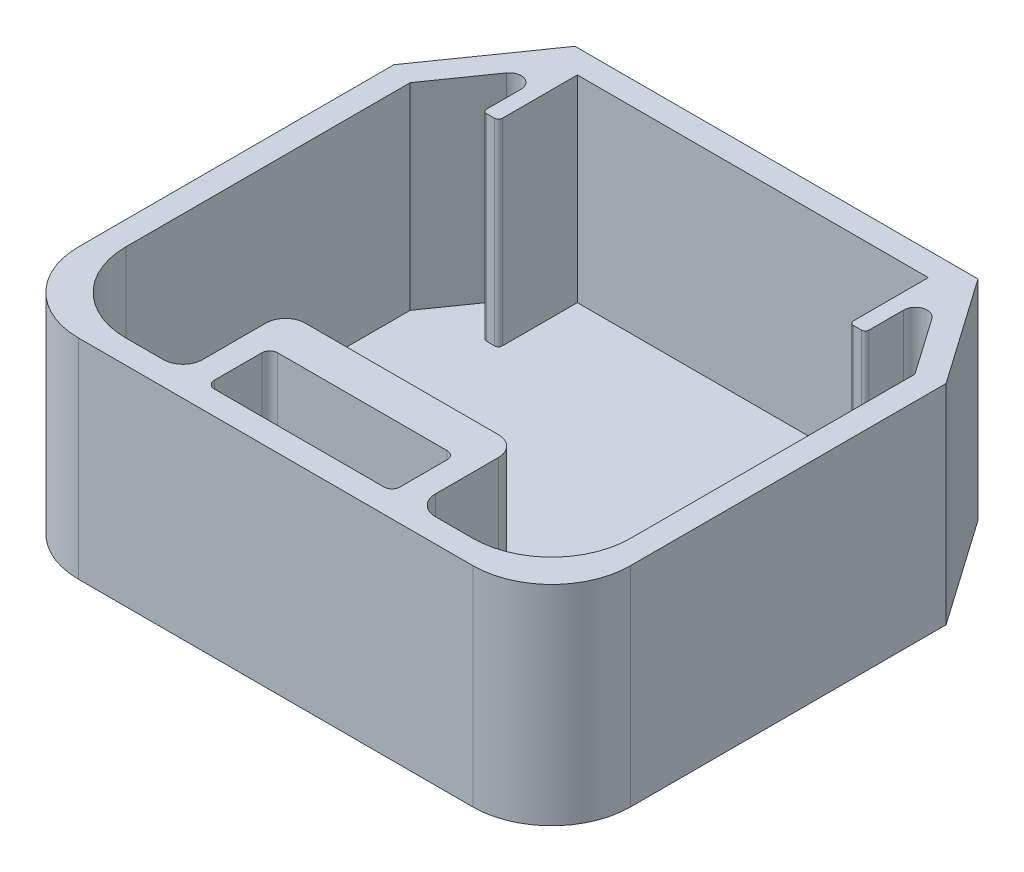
ISO-10303-21;
HEADER;
FILE_DESCRIPTION(('STEP AP214'),'2;1');
FILE_NAME('part.step','',(''),(''),'','','');
FILE_SCHEMA(('AUTOMOTIVE_DESIGN { 1 0 10303 214 1 1 1 1 }'));
ENDSEC;
DATA;
#1=APPLICATION_CONTEXT('core data for automotive mechanical design processes');
#2=APPLICATION_PROTOCOL_DEFINITION('international standard','automotive_design',2000,#1);
#3=PRODUCT_CONTEXT('',#1,'mechanical');
#4=PRODUCT('Part','Part','',(#3));
#5=PRODUCT_RELATED_PRODUCT_CATEGORY('part','',(#4));
#6=PRODUCT_DEFINITION_FORMATION('','',#4);
#7=PRODUCT_DEFINITION_CONTEXT('part definition',#1,'design');
#8=PRODUCT_DEFINITION('design','',#6,#7);
#9=PRODUCT_DEFINITION_SHAPE('','',#8);
#10=(LENGTH_UNIT() NAMED_UNIT(*) SI_UNIT(.MILLI.,.METRE.));
#11=(NAMED_UNIT(*) PLANE_ANGLE_UNIT() SI_UNIT($,.RADIAN.));
#12=(NAMED_UNIT(*) SI_UNIT($,.STERADIAN.) SOLID_ANGLE_UNIT());
#13=UNCERTAINTY_MEASURE_WITH_UNIT(LENGTH_MEASURE(1.E-05),#10,'distance_accuracy_value','');
#14=(GEOMETRIC_REPRESENTATION_CONTEXT(3) GLOBAL_UNCERTAINTY_ASSIGNED_CONTEXT((#13)) GLOBAL_UNIT_ASSIGNED_CONTEXT((#10,
#11,#12)) REPRESENTATION_CONTEXT('',''));
#15=CARTESIAN_POINT('',(0.,0.,0.));
#16=DIRECTION('',(0.,0.,1.));
#17=DIRECTION('',(1.,0.,0.));
#18=AXIS2_PLACEMENT_3D('',#15,#16,#17);
#19=CARTESIAN_POINT('',(0.,0.3,0.));
#20=DIRECTION('',(0.,1.,0.));
#21=DIRECTION('',(0.,0.,1.));
#22=AXIS2_PLACEMENT_3D('',#19,#20,#21);
#23=PLANE('',#22);
#24=DIRECTION('',(-0.57357643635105,0.,-0.819152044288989));
#25=VECTOR('',#24,1.);
#26=CARTESIAN_POINT('',(6.4,0.3,-3.46082072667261));
#27=LINE('',#26,#25);
#28=CARTESIAN_POINT('',(6.4,0.3,-3.46082072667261));
#29=VERTEX_POINT('',#28);
#30=CARTESIAN_POINT('',(5.3957456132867,0.3,-4.89504462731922));
#31=VERTEX_POINT('',#30);
#32=EDGE_CURVE('E369',#29,#31,#27,.T.);
#33=ORIENTED_EDGE('',*,*,#32,.T.);
#34=CARTESIAN_POINT('',(5.15,0.3,-4.72297169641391));
#35=DIRECTION('',(0.,1.,0.));
#36=DIRECTION('',(0.,0.,1.));
#37=AXIS2_PLACEMENT_3D('',#34,#35,#36);
#38=CIRCLE('',#37,0.3);
#39=CARTESIAN_POINT('',(4.85,0.3,-4.72297169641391));
#40=VERTEX_POINT('',#39);
#41=EDGE_CURVE('E528',#31,#40,#38,.T.);
#42=ORIENTED_EDGE('',*,*,#41,.T.);
#43=DIRECTION('',(0.,0.,-1.));
#44=VECTOR('',#43,1.);
#45=CARTESIAN_POINT('',(4.85,0.3,-5.75));
#46=LINE('',#45,#44);
#47=CARTESIAN_POINT('',(4.85,0.3,-3.85));
#48=VERTEX_POINT('',#47);
#49=EDGE_CURVE('E606',#48,#40,#46,.T.);
#50=ORIENTED_EDGE('',*,*,#49,.F.);
#51=CARTESIAN_POINT('',(4.75,0.3,-3.85));
#52=DIRECTION('',(0.,1.,0.));
#53=DIRECTION('',(0.,0.,1.));
#54=AXIS2_PLACEMENT_3D('',#51,#52,#53);
#55=CIRCLE('',#54,0.1);
#56=CARTESIAN_POINT('',(4.75,0.3,-3.75));
#57=VERTEX_POINT('',#56);
#58=EDGE_CURVE('E569',#48,#57,#55,.F.);
#59=ORIENTED_EDGE('',*,*,#58,.T.);
#60=DIRECTION('',(1.,0.,0.));
#61=VECTOR('',#60,1.);
#62=CARTESIAN_POINT('',(4.45,0.3,-3.75));
#63=LINE('',#62,#61);
#64=CARTESIAN_POINT('',(4.55,0.3,-3.75));
#65=VERTEX_POINT('',#64);
#66=EDGE_CURVE('E577',#65,#57,#63,.T.);
#67=ORIENTED_EDGE('',*,*,#66,.F.);
#68=CARTESIAN_POINT('',(4.55,0.3,-3.85));
#69=DIRECTION('',(0.,1.,0.));
#70=DIRECTION('',(0.,0.,1.));
#71=AXIS2_PLACEMENT_3D('',#68,#69,#70);
#72=CIRCLE('',#71,0.1);
#73=CARTESIAN_POINT('',(4.45,0.3,-3.85));
#74=VERTEX_POINT('',#73);
#75=EDGE_CURVE('E571',#65,#74,#72,.F.);
#76=ORIENTED_EDGE('',*,*,#75,.T.);
#77=DIRECTION('',(0.,0.,1.));
#78=VECTOR('',#77,1.);
#79=CARTESIAN_POINT('',(4.45,0.3,-3.75));
#80=LINE('',#79,#78);
#81=CARTESIAN_POINT('',(4.45,0.3,-5.75));
#82=VERTEX_POINT('',#81);
#83=EDGE_CURVE('E574',#82,#74,#80,.T.);
#84=ORIENTED_EDGE('',*,*,#83,.F.);
#85=DIRECTION('',(-1.,0.,0.));
#86=VECTOR('',#85,1.);
#87=CARTESIAN_POINT('',(4.79709941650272,0.3,-5.75));
#88=LINE('',#87,#86);
#89=CARTESIAN_POINT('',(-4.45,0.3,-5.75));
#90=VERTEX_POINT('',#89);
#91=EDGE_CURVE('E355',#82,#90,#88,.T.);
#92=ORIENTED_EDGE('',*,*,#91,.T.);
#93=DIRECTION('',(0.,0.,-1.));
#94=VECTOR('',#93,1.);
#95=CARTESIAN_POINT('',(-4.45,0.3,-5.75));
#96=LINE('',#95,#94);
#97=CARTESIAN_POINT('',(-4.45,0.3,-3.85));
#98=VERTEX_POINT('',#97);
#99=EDGE_CURVE('E607',#98,#90,#96,.T.);
#100=ORIENTED_EDGE('',*,*,#99,.F.);
#101=CARTESIAN_POINT('',(-4.55,0.3,-3.85));
#102=DIRECTION('',(0.,1.,0.));
#103=DIRECTION('',(0.,0.,1.));
#104=AXIS2_PLACEMENT_3D('',#101,#102,#103);
#105=CIRCLE('',#104,0.1);
#106=CARTESIAN_POINT('',(-4.55,0.3,-3.75));
#107=VERTEX_POINT('',#106);
#108=EDGE_CURVE('E42',#98,#107,#105,.F.);
#109=ORIENTED_EDGE('',*,*,#108,.T.);
#110=DIRECTION('',(1.,0.,0.));
#111=VECTOR('',#110,1.);
#112=CARTESIAN_POINT('',(-4.85,0.3,-3.75));
#113=LINE('',#112,#111);
#114=CARTESIAN_POINT('',(-4.75,0.3,-3.75));
#115=VERTEX_POINT('',#114);
#116=EDGE_CURVE('E610',#115,#107,#113,.T.);
#117=ORIENTED_EDGE('',*,*,#116,.F.);
#118=CARTESIAN_POINT('',(-4.75,0.3,-3.85));
#119=DIRECTION('',(0.,1.,0.));
#120=DIRECTION('',(0.,0.,1.));
#121=AXIS2_PLACEMENT_3D('',#118,#119,#120);
#122=CIRCLE('',#121,0.1);
#123=CARTESIAN_POINT('',(-4.85,0.3,-3.85));
#124=VERTEX_POINT('',#123);
#125=EDGE_CURVE('E11',#115,#124,#122,.F.);
#126=ORIENTED_EDGE('',*,*,#125,.T.);
#127=DIRECTION('',(0.,0.,1.));
#128=VECTOR('',#127,1.);
#129=CARTESIAN_POINT('',(-4.85,0.3,-5.75));
#130=LINE('',#129,#128);
#131=CARTESIAN_POINT('',(-4.85,0.3,-4.72297169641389));
#132=VERTEX_POINT('',#131);
#133=EDGE_CURVE('E612',#132,#124,#130,.T.);
#134=ORIENTED_EDGE('',*,*,#133,.F.);
#135=CARTESIAN_POINT('',(-5.15,0.3,-4.72297169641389));
#136=DIRECTION('',(0.,1.,0.));
#137=DIRECTION('',(0.,0.,1.));
#138=AXIS2_PLACEMENT_3D('',#135,#136,#137);
#139=CIRCLE('',#138,0.3);
#140=CARTESIAN_POINT('',(-5.3957456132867,0.3,-4.89504462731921));
#141=VERTEX_POINT('',#140);
#142=EDGE_CURVE('E526',#132,#141,#139,.T.);
#143=ORIENTED_EDGE('',*,*,#142,.T.);
#144=DIRECTION('',(-0.573576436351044,0.,0.819152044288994));
#145=VECTOR('',#144,1.);
#146=CARTESIAN_POINT('',(-4.79709941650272,0.3,-5.75));
#147=LINE('',#146,#145);
#148=CARTESIAN_POINT('',(-6.4,0.3,-3.46082072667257));
#149=VERTEX_POINT('',#148);
#150=EDGE_CURVE('E358',#141,#149,#147,.T.);
#151=ORIENTED_EDGE('',*,*,#150,.T.);
#152=DIRECTION('',(0.,0.,1.));
#153=VECTOR('',#152,1.);
#154=CARTESIAN_POINT('',(-6.4,0.3,-3.46082072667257));
#155=LINE('',#154,#153);
#156=CARTESIAN_POINT('',(-6.4,0.3,3.75));
#157=VERTEX_POINT('',#156);
#158=EDGE_CURVE('E332',#149,#157,#155,.T.);
#159=ORIENTED_EDGE('',*,*,#158,.T.);
#160=CARTESIAN_POINT('',(-4.4,0.3,3.75));
#161=DIRECTION('',(0.,1.,0.));
#162=DIRECTION('',(0.,0.,1.));
#163=AXIS2_PLACEMENT_3D('',#160,#161,#162);
#164=CIRCLE('',#163,2.);
#165=CARTESIAN_POINT('',(-4.4,0.3,5.75));
#166=VERTEX_POINT('',#165);
#167=EDGE_CURVE('E439',#157,#166,#164,.T.);
#168=ORIENTED_EDGE('',*,*,#167,.T.);
#169=DIRECTION('',(1.,0.,0.));
#170=VECTOR('',#169,1.);
#171=CARTESIAN_POINT('',(-6.4,0.3,5.75));
#172=LINE('',#171,#170);
#173=CARTESIAN_POINT('',(-3.45,0.3,5.75));
#174=VERTEX_POINT('',#173);
#175=EDGE_CURVE('E363',#166,#174,#172,.T.);
#176=ORIENTED_EDGE('',*,*,#175,.T.);
#177=CARTESIAN_POINT('',(-3.45,0.3,5.25));
#178=DIRECTION('',(0.,1.,0.));
#179=DIRECTION('',(0.,0.,1.));
#180=AXIS2_PLACEMENT_3D('',#177,#178,#179);
#181=CIRCLE('',#180,0.5);
#182=CARTESIAN_POINT('',(-2.95,0.3,5.25));
#183=VERTEX_POINT('',#182);
#184=EDGE_CURVE('E460',#174,#183,#181,.T.);
#185=ORIENTED_EDGE('',*,*,#184,.T.);
#186=DIRECTION('',(0.,0.,-1.));
#187=VECTOR('',#186,1.);
#188=CARTESIAN_POINT('',(-2.95,0.3,3.15));
#189=LINE('',#188,#187);
#190=CARTESIAN_POINT('',(-2.95,0.3,3.65));
#191=VERTEX_POINT('',#190);
#192=EDGE_CURVE('E637',#183,#191,#189,.T.);
#193=ORIENTED_EDGE('',*,*,#192,.T.);
#194=CARTESIAN_POINT('',(-2.45,0.3,3.65));
#195=DIRECTION('',(0.,1.,0.));
#196=DIRECTION('',(0.,0.,1.));
#197=AXIS2_PLACEMENT_3D('',#194,#195,#196);
#198=CIRCLE('',#197,0.5);
#199=CARTESIAN_POINT('',(-2.45,0.3,3.15));
#200=VERTEX_POINT('',#199);
#201=EDGE_CURVE('E485',#191,#200,#198,.F.);
#202=ORIENTED_EDGE('',*,*,#201,.T.);
#203=DIRECTION('',(1.,0.,0.));
#204=VECTOR('',#203,1.);
#205=CARTESIAN_POINT('',(2.95,0.3,3.15));
#206=LINE('',#205,#204);
#207=CARTESIAN_POINT('',(2.45,0.3,3.15));
#208=VERTEX_POINT('',#207);
#209=EDGE_CURVE('E634',#200,#208,#206,.T.);
#210=ORIENTED_EDGE('',*,*,#209,.T.);
#211=CARTESIAN_POINT('',(2.45,0.3,3.65));
#212=DIRECTION('',(0.,1.,0.));
#213=DIRECTION('',(0.,0.,1.));
#214=AXIS2_PLACEMENT_3D('',#211,#212,#213);
#215=CIRCLE('',#214,0.5);
#216=CARTESIAN_POINT('',(2.95,0.3,3.65));
#217=VERTEX_POINT('',#216);
#218=EDGE_CURVE('E483',#208,#217,#215,.F.);
#219=ORIENTED_EDGE('',*,*,#218,.T.);
#220=DIRECTION('',(0.,0.,1.));
#221=VECTOR('',#220,1.);
#222=CARTESIAN_POINT('',(2.95,0.3,5.75));
#223=LINE('',#222,#221);
#224=CARTESIAN_POINT('',(2.95,0.3,5.25));
#225=VERTEX_POINT('',#224);
#226=EDGE_CURVE('E631',#217,#225,#223,.T.);
#227=ORIENTED_EDGE('',*,*,#226,.T.);
#228=CARTESIAN_POINT('',(3.45,0.3,5.25));
#229=DIRECTION('',(0.,1.,0.));
#230=DIRECTION('',(0.,0.,1.));
#231=AXIS2_PLACEMENT_3D('',#228,#229,#230);
#232=CIRCLE('',#231,0.5);
#233=CARTESIAN_POINT('',(3.45,0.3,5.75));
#234=VERTEX_POINT('',#233);
#235=EDGE_CURVE('E458',#225,#234,#232,.T.);
#236=ORIENTED_EDGE('',*,*,#235,.T.);
#237=CARTESIAN_POINT('',(4.4,0.3,5.75));
#238=VERTEX_POINT('',#237);
#239=EDGE_CURVE('E362',#234,#238,#172,.T.);
#240=ORIENTED_EDGE('',*,*,#239,.T.);
#241=CARTESIAN_POINT('',(4.4,0.3,3.75));
#242=DIRECTION('',(0.,1.,0.));
#243=DIRECTION('',(0.,0.,1.));
#244=AXIS2_PLACEMENT_3D('',#241,#242,#243);
#245=CIRCLE('',#244,2.);
#246=CARTESIAN_POINT('',(6.4,0.3,3.75));
#247=VERTEX_POINT('',#246);
#248=EDGE_CURVE('E441',#238,#247,#245,.T.);
#249=ORIENTED_EDGE('',*,*,#248,.T.);
#250=DIRECTION('',(0.,0.,-1.));
#251=VECTOR('',#250,1.);
#252=CARTESIAN_POINT('',(6.4,0.3,5.75));
#253=LINE('',#252,#251);
#254=EDGE_CURVE('E366',#247,#29,#253,.T.);
#255=ORIENTED_EDGE('',*,*,#254,.T.);
#256=EDGE_LOOP('',(#33,#42,#50,#59,#67,#76,#84,#92,#100,#109,#117,#126,#134,#143,#151,#159,#168,
#176,#185,#193,#202,#210,#219,#227,#236,#240,#249,#255));
#257=FACE_BOUND('',#256,.T.);
#258=ADVANCED_FACE('F34',(#257),#23,.T.);
#259=CARTESIAN_POINT('',(4.79709941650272,5.3,-5.75));
#260=DIRECTION('',(0.,0.,1.));
#261=DIRECTION('',(1.,0.,0.));
#262=AXIS2_PLACEMENT_3D('',#259,#260,#261);
#263=PLANE('',#262);
#264=ORIENTED_EDGE('',*,*,#91,.F.);
#265=DIRECTION('',(0.,-1.,0.));
#266=VECTOR('',#265,1.);
#267=CARTESIAN_POINT('',(4.45,7.33960780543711,-5.75));
#268=LINE('',#267,#266);
#269=CARTESIAN_POINT('',(4.45,5.3,-5.75));
#270=VERTEX_POINT('',#269);
#271=EDGE_CURVE('E586',#270,#82,#268,.T.);
#272=ORIENTED_EDGE('',*,*,#271,.F.);
#273=DIRECTION('',(-1.,0.,0.));
#274=VECTOR('',#273,1.);
#275=CARTESIAN_POINT('',(4.79709941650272,5.3,-5.75));
#276=LINE('',#275,#274);
#277=CARTESIAN_POINT('',(-4.45,5.3,-5.75));
#278=VERTEX_POINT('',#277);
#279=EDGE_CURVE('E324',#270,#278,#276,.T.);
#280=ORIENTED_EDGE('',*,*,#279,.T.);
#281=DIRECTION('',(0.,-1.,0.));
#282=VECTOR('',#281,1.);
#283=CARTESIAN_POINT('',(-4.45,7.33960780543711,-5.75));
#284=LINE('',#283,#282);
#285=EDGE_CURVE('E600',#278,#90,#284,.T.);
#286=ORIENTED_EDGE('',*,*,#285,.T.);
#287=EDGE_LOOP('',(#264,#272,#280,#286));
#288=FACE_BOUND('',#287,.T.);
#289=ADVANCED_FACE('F660',(#288),#263,.T.);
#290=CARTESIAN_POINT('',(6.4,5.3,-3.46082072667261));
#291=DIRECTION('',(-0.819152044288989,0.,0.57357643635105));
#292=DIRECTION('',(0.57357643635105,0.,0.819152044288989));
#293=AXIS2_PLACEMENT_3D('',#290,#291,#292);
#294=PLANE('',#293);
#295=DIRECTION('',(-0.57357643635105,0.,-0.819152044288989));
#296=VECTOR('',#295,1.);
#297=CARTESIAN_POINT('',(6.4,5.3,-3.46082072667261));
#298=LINE('',#297,#296);
#299=CARTESIAN_POINT('',(6.4,5.3,-3.46082072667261));
#300=VERTEX_POINT('',#299);
#301=CARTESIAN_POINT('',(5.3957456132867,5.3,-4.89504462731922));
#302=VERTEX_POINT('',#301);
#303=EDGE_CURVE('E352',#300,#302,#298,.T.);
#304=ORIENTED_EDGE('',*,*,#303,.T.);
#305=DIRECTION('',(0.,-1.,0.));
#306=VECTOR('',#305,1.);
#307=CARTESIAN_POINT('',(5.3957456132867,5.3,-4.89504462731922));
#308=LINE('',#307,#306);
#309=EDGE_CURVE('E523',#302,#31,#308,.T.);
#310=ORIENTED_EDGE('',*,*,#309,.T.);
#311=ORIENTED_EDGE('',*,*,#32,.F.);
#312=DIRECTION('',(0.,-1.,0.));
#313=VECTOR('',#312,1.);
#314=CARTESIAN_POINT('',(6.4,5.3,-3.46082072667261));
#315=LINE('',#314,#313);
#316=EDGE_CURVE('E334',#300,#29,#315,.T.);
#317=ORIENTED_EDGE('',*,*,#316,.F.);
#318=EDGE_LOOP('',(#304,#310,#311,#317));
#319=FACE_BOUND('',#318,.T.);
#320=ADVANCED_FACE('F701',(#319),#294,.T.);
#321=CARTESIAN_POINT('',(-4.79709941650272,5.3,-5.75));
#322=DIRECTION('',(0.819152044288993,0.,0.573576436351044));
#323=DIRECTION('',(0.573576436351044,0.,-0.819152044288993));
#324=AXIS2_PLACEMENT_3D('',#321,#322,#323);
#325=PLANE('',#324);
#326=ORIENTED_EDGE('',*,*,#150,.F.);
#327=DIRECTION('',(0.,1.,0.));
#328=VECTOR('',#327,1.);
#329=CARTESIAN_POINT('',(-5.3957456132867,5.3,-4.89504462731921));
#330=LINE('',#329,#328);
#331=CARTESIAN_POINT('',(-5.3957456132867,5.3,-4.89504462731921));
#332=VERTEX_POINT('',#331);
#333=EDGE_CURVE('E320',#141,#332,#330,.T.);
#334=ORIENTED_EDGE('',*,*,#333,.T.);
#335=DIRECTION('',(-0.573576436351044,0.,0.819152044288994));
#336=VECTOR('',#335,1.);
#337=CARTESIAN_POINT('',(-4.79709941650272,5.3,-5.75));
#338=LINE('',#337,#336);
#339=CARTESIAN_POINT('',(-6.4,5.3,-3.46082072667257));
#340=VERTEX_POINT('',#339);
#341=EDGE_CURVE('E313',#332,#340,#338,.T.);
#342=ORIENTED_EDGE('',*,*,#341,.T.);
#343=DIRECTION('',(0.,-1.,0.));
#344=VECTOR('',#343,1.);
#345=CARTESIAN_POINT('',(-6.4,5.3,-3.46082072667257));
#346=LINE('',#345,#344);
#347=EDGE_CURVE('E317',#340,#149,#346,.T.);
#348=ORIENTED_EDGE('',*,*,#347,.T.);
#349=EDGE_LOOP('',(#326,#334,#342,#348));
#350=FACE_BOUND('',#349,.T.);
#351=ADVANCED_FACE('F316',(#350),#325,.T.);
#352=CARTESIAN_POINT('',(-6.4,5.3,5.75));
#353=DIRECTION('',(0.,0.,-1.));
#354=DIRECTION('',(-1.,0.,0.));
#355=AXIS2_PLACEMENT_3D('',#352,#353,#354);
#356=PLANE('',#355);
#357=ORIENTED_EDGE('',*,*,#239,.F.);
#358=DIRECTION('',(0.,1.,0.));
#359=VECTOR('',#358,1.);
#360=CARTESIAN_POINT('',(3.45,5.3,5.75));
#361=LINE('',#360,#359);
#362=CARTESIAN_POINT('',(3.45,5.3,5.75));
#363=VERTEX_POINT('',#362);
#364=EDGE_CURVE('E462',#234,#363,#361,.T.);
#365=ORIENTED_EDGE('',*,*,#364,.T.);
#366=DIRECTION('',(1.,0.,0.));
#367=VECTOR('',#366,1.);
#368=CARTESIAN_POINT('',(-6.4,5.3,5.75));
#369=LINE('',#368,#367);
#370=CARTESIAN_POINT('',(4.4,5.3,5.75));
#371=VERTEX_POINT('',#370);
#372=EDGE_CURVE('E342',#363,#371,#369,.T.);
#373=ORIENTED_EDGE('',*,*,#372,.T.);
#374=DIRECTION('',(0.,-1.,0.));
#375=VECTOR('',#374,1.);
#376=CARTESIAN_POINT('',(4.4,0.3,5.75));
#377=LINE('',#376,#375);
#378=EDGE_CURVE('E436',#371,#238,#377,.T.);
#379=ORIENTED_EDGE('',*,*,#378,.T.);
#380=EDGE_LOOP('',(#357,#365,#373,#379));
#381=FACE_BOUND('',#380,.T.);
#382=ADVANCED_FACE('F759',(#381),#356,.T.);
#383=CARTESIAN_POINT('',(-4.4,5.3,5.75));
#384=VERTEX_POINT('',#383);
#385=CARTESIAN_POINT('',(-3.45,5.3,5.75));
#386=VERTEX_POINT('',#385);
#387=EDGE_CURVE('E346',#384,#386,#369,.T.);
#388=ORIENTED_EDGE('',*,*,#387,.T.);
#389=DIRECTION('',(0.,1.,0.));
#390=VECTOR('',#389,1.);
#391=CARTESIAN_POINT('',(-3.45,0.3,5.75));
#392=LINE('',#391,#390);
#393=EDGE_CURVE('E456',#386,#174,#392,.F.);
#394=ORIENTED_EDGE('',*,*,#393,.T.);
#395=ORIENTED_EDGE('',*,*,#175,.F.);
#396=DIRECTION('',(0.,-1.,0.));
#397=VECTOR('',#396,1.);
#398=CARTESIAN_POINT('',(-4.4,5.3,5.75));
#399=LINE('',#398,#397);
#400=EDGE_CURVE('E434',#166,#384,#399,.F.);
#401=ORIENTED_EDGE('',*,*,#400,.T.);
#402=EDGE_LOOP('',(#388,#394,#395,#401));
#403=FACE_BOUND('',#402,.T.);
#404=ADVANCED_FACE('F760',(#403),#356,.T.);
#405=CARTESIAN_POINT('',(-7.,0.3,-3.64999999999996));
#406=DIRECTION('',(1.,0.,0.));
#407=DIRECTION('',(0.,0.,-1.));
#408=AXIS2_PLACEMENT_3D('',#405,#406,#407);
#409=PLANE('',#408);
#410=DIRECTION('',(0.,0.,1.));
#411=VECTOR('',#410,1.);
#412=CARTESIAN_POINT('',(-7.,0.,-3.64999999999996));
#413=LINE('',#412,#411);
#414=CARTESIAN_POINT('',(-7.,0.,-3.64999999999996));
#415=VERTEX_POINT('',#414);
#416=CARTESIAN_POINT('',(-7.,0.,4.35));
#417=VERTEX_POINT('',#416);
#418=EDGE_CURVE('E390',#415,#417,#413,.T.);
#419=ORIENTED_EDGE('',*,*,#418,.T.);
#420=DIRECTION('',(0.,-1.,0.));
#421=VECTOR('',#420,1.);
#422=CARTESIAN_POINT('',(-7.,0.3,4.35));
#423=LINE('',#422,#421);
#424=CARTESIAN_POINT('',(-7.,5.3,4.35));
#425=VERTEX_POINT('',#424);
#426=EDGE_CURVE('E425',#417,#425,#423,.F.);
#427=ORIENTED_EDGE('',*,*,#426,.T.);
#428=DIRECTION('',(0.,0.,1.));
#429=VECTOR('',#428,1.);
#430=CARTESIAN_POINT('',(-7.,5.3,-3.64999999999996));
#431=LINE('',#430,#429);
#432=CARTESIAN_POINT('',(-7.,5.3,-3.64999999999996));
#433=VERTEX_POINT('',#432);
#434=EDGE_CURVE('E379',#433,#425,#431,.T.);
#435=ORIENTED_EDGE('',*,*,#434,.F.);
#436=DIRECTION('',(0.,-1.,0.));
#437=VECTOR('',#436,1.);
#438=CARTESIAN_POINT('',(-7.,0.3,-3.64999999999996));
#439=LINE('',#438,#437);
#440=EDGE_CURVE('E404',#433,#415,#439,.T.);
#441=ORIENTED_EDGE('',*,*,#440,.T.);
#442=EDGE_LOOP('',(#419,#427,#435,#441));
#443=FACE_BOUND('',#442,.T.);
#444=ADVANCED_FACE('F768',(#443),#409,.F.);
#445=CARTESIAN_POINT('',(-7.,0.3,6.35));
#446=DIRECTION('',(0.,0.,-1.));
#447=DIRECTION('',(-1.,0.,0.));
#448=AXIS2_PLACEMENT_3D('',#445,#446,#447);
#449=PLANE('',#448);
#450=DIRECTION('',(1.,0.,0.));
#451=VECTOR('',#450,1.);
#452=CARTESIAN_POINT('',(-7.,5.3,6.35));
#453=LINE('',#452,#451);
#454=CARTESIAN_POINT('',(-5.,5.3,6.35));
#455=VERTEX_POINT('',#454);
#456=CARTESIAN_POINT('',(5.,5.3,6.35));
#457=VERTEX_POINT('',#456);
#458=EDGE_CURVE('E382',#455,#457,#453,.T.);
#459=ORIENTED_EDGE('',*,*,#458,.F.);
#460=DIRECTION('',(0.,-1.,0.));
#461=VECTOR('',#460,1.);
#462=CARTESIAN_POINT('',(-5.,0.3,6.35));
#463=LINE('',#462,#461);
#464=CARTESIAN_POINT('',(-5.,0.,6.35));
#465=VERTEX_POINT('',#464);
#466=EDGE_CURVE('E418',#455,#465,#463,.T.);
#467=ORIENTED_EDGE('',*,*,#466,.T.);
#468=DIRECTION('',(1.,0.,0.));
#469=VECTOR('',#468,1.);
#470=CARTESIAN_POINT('',(-7.,0.,6.35));
#471=LINE('',#470,#469);
#472=CARTESIAN_POINT('',(5.,0.,6.35));
#473=VERTEX_POINT('',#472);
#474=EDGE_CURVE('E393',#465,#473,#471,.T.);
#475=ORIENTED_EDGE('',*,*,#474,.T.);
#476=DIRECTION('',(0.,-1.,0.));
#477=VECTOR('',#476,1.);
#478=CARTESIAN_POINT('',(5.,0.3,6.35));
#479=LINE('',#478,#477);
#480=EDGE_CURVE('E416',#473,#457,#479,.F.);
#481=ORIENTED_EDGE('',*,*,#480,.T.);
#482=EDGE_LOOP('',(#459,#467,#475,#481));
#483=FACE_BOUND('',#482,.T.);
#484=ADVANCED_FACE('F773',(#483),#449,.F.);
#485=CARTESIAN_POINT('',(7.,0.3,-3.65));
#486=DIRECTION('',(-1.,0.,0.));
#487=DIRECTION('',(0.,0.,1.));
#488=AXIS2_PLACEMENT_3D('',#485,#486,#487);
#489=PLANE('',#488);
#490=DIRECTION('',(0.,0.,-1.));
#491=VECTOR('',#490,1.);
#492=CARTESIAN_POINT('',(7.,5.3,6.35));
#493=LINE('',#492,#491);
#494=CARTESIAN_POINT('',(7.,5.3,4.35));
#495=VERTEX_POINT('',#494);
#496=CARTESIAN_POINT('',(7.,5.3,-3.65));
#497=VERTEX_POINT('',#496);
#498=EDGE_CURVE('E385',#495,#497,#493,.T.);
#499=ORIENTED_EDGE('',*,*,#498,.F.);
#500=DIRECTION('',(0.,-1.,0.));
#501=VECTOR('',#500,1.);
#502=CARTESIAN_POINT('',(7.,0.3,4.35));
#503=LINE('',#502,#501);
#504=CARTESIAN_POINT('',(7.,0.,4.35));
#505=VERTEX_POINT('',#504);
#506=EDGE_CURVE('E431',#495,#505,#503,.T.);
#507=ORIENTED_EDGE('',*,*,#506,.T.);
#508=DIRECTION('',(0.,0.,-1.));
#509=VECTOR('',#508,1.);
#510=CARTESIAN_POINT('',(7.,0.,-3.65));
#511=LINE('',#510,#509);
#512=CARTESIAN_POINT('',(7.,0.,-3.65));
#513=VERTEX_POINT('',#512);
#514=EDGE_CURVE('E396',#505,#513,#511,.T.);
#515=ORIENTED_EDGE('',*,*,#514,.T.);
#516=DIRECTION('',(0.,-1.,0.));
#517=VECTOR('',#516,1.);
#518=CARTESIAN_POINT('',(7.,0.3,-3.65));
#519=LINE('',#518,#517);
#520=EDGE_CURVE('E413',#497,#513,#519,.T.);
#521=ORIENTED_EDGE('',*,*,#520,.F.);
#522=EDGE_LOOP('',(#499,#507,#515,#521));
#523=FACE_BOUND('',#522,.T.);
#524=ADVANCED_FACE('F889',(#523),#489,.F.);
#525=CARTESIAN_POINT('',(5.10943964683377,0.3,-6.35));
#526=DIRECTION('',(-0.819152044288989,0.,0.57357643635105));
#527=DIRECTION('',(0.57357643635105,0.,0.819152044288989));
#528=AXIS2_PLACEMENT_3D('',#525,#526,#527);
#529=PLANE('',#528);
#530=DIRECTION('',(-0.57357643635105,0.,-0.819152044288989));
#531=VECTOR('',#530,1.);
#532=CARTESIAN_POINT('',(5.10943964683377,0.,-6.35));
#533=LINE('',#532,#531);
#534=CARTESIAN_POINT('',(5.10943964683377,0.,-6.35));
#535=VERTEX_POINT('',#534);
#536=EDGE_CURVE('E398',#513,#535,#533,.T.);
#537=ORIENTED_EDGE('',*,*,#536,.T.);
#538=DIRECTION('',(0.,-1.,0.));
#539=VECTOR('',#538,1.);
#540=CARTESIAN_POINT('',(5.10943964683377,0.3,-6.35));
#541=LINE('',#540,#539);
#542=CARTESIAN_POINT('',(5.10943964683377,5.3,-6.35));
#543=VERTEX_POINT('',#542);
#544=EDGE_CURVE('E410',#543,#535,#541,.T.);
#545=ORIENTED_EDGE('',*,*,#544,.F.);
#546=DIRECTION('',(-0.57357643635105,0.,-0.819152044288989));
#547=VECTOR('',#546,1.);
#548=CARTESIAN_POINT('',(7.,5.3,-3.65));
#549=LINE('',#548,#547);
#550=EDGE_CURVE('E387',#497,#543,#549,.T.);
#551=ORIENTED_EDGE('',*,*,#550,.F.);
#552=ORIENTED_EDGE('',*,*,#520,.T.);
#553=EDGE_LOOP('',(#537,#545,#551,#552));
#554=FACE_BOUND('',#553,.T.);
#555=ADVANCED_FACE('F885',(#554),#529,.F.);
#556=CARTESIAN_POINT('',(5.10943964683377,0.3,-6.35));
#557=DIRECTION('',(0.,0.,1.));
#558=DIRECTION('',(1.,0.,0.));
#559=AXIS2_PLACEMENT_3D('',#556,#557,#558);
#560=PLANE('',#559);
#561=DIRECTION('',(-1.,0.,0.));
#562=VECTOR('',#561,1.);
#563=CARTESIAN_POINT('',(5.10943964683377,0.,-6.35));
#564=LINE('',#563,#562);
#565=CARTESIAN_POINT('',(-5.10943964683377,0.,-6.35));
#566=VERTEX_POINT('',#565);
#567=EDGE_CURVE('E400',#535,#566,#564,.T.);
#568=ORIENTED_EDGE('',*,*,#567,.T.);
#569=DIRECTION('',(0.,-1.,0.));
#570=VECTOR('',#569,1.);
#571=CARTESIAN_POINT('',(-5.10943964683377,0.3,-6.35));
#572=LINE('',#571,#570);
#573=CARTESIAN_POINT('',(-5.10943964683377,5.3,-6.35));
#574=VERTEX_POINT('',#573);
#575=EDGE_CURVE('E407',#574,#566,#572,.T.);
#576=ORIENTED_EDGE('',*,*,#575,.F.);
#577=DIRECTION('',(-1.,0.,0.));
#578=VECTOR('',#577,1.);
#579=CARTESIAN_POINT('',(5.10943964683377,5.3,-6.35));
#580=LINE('',#579,#578);
#581=EDGE_CURVE('E333',#543,#574,#580,.T.);
#582=ORIENTED_EDGE('',*,*,#581,.F.);
#583=ORIENTED_EDGE('',*,*,#544,.T.);
#584=EDGE_LOOP('',(#568,#576,#582,#583));
#585=FACE_BOUND('',#584,.T.);
#586=ADVANCED_FACE('F878',(#585),#560,.F.);
#587=CARTESIAN_POINT('',(-5.10943964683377,0.3,-6.35));
#588=DIRECTION('',(0.819152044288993,0.,0.573576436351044));
#589=DIRECTION('',(0.573576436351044,0.,-0.819152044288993));
#590=AXIS2_PLACEMENT_3D('',#587,#588,#589);
#591=PLANE('',#590);
#592=DIRECTION('',(-0.573576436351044,0.,0.819152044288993));
#593=VECTOR('',#592,1.);
#594=CARTESIAN_POINT('',(-5.10943964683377,0.,-6.35));
#595=LINE('',#594,#593);
#596=EDGE_CURVE('E402',#566,#415,#595,.T.);
#597=ORIENTED_EDGE('',*,*,#596,.T.);
#598=ORIENTED_EDGE('',*,*,#440,.F.);
#599=DIRECTION('',(-0.573576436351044,0.,0.819152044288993));
#600=VECTOR('',#599,1.);
#601=CARTESIAN_POINT('',(-5.10943964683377,5.3,-6.35));
#602=LINE('',#601,#600);
#603=EDGE_CURVE('E376',#574,#433,#602,.T.);
#604=ORIENTED_EDGE('',*,*,#603,.F.);
#605=ORIENTED_EDGE('',*,*,#575,.T.);
#606=EDGE_LOOP('',(#597,#598,#604,#605));
#607=FACE_BOUND('',#606,.T.);
#608=ADVANCED_FACE('F873',(#607),#591,.F.);
#609=CARTESIAN_POINT('',(0.,0.,0.));
#610=DIRECTION('',(0.,1.,0.));
#611=DIRECTION('',(0.,0.,1.));
#612=AXIS2_PLACEMENT_3D('',#609,#610,#611);
#613=PLANE('',#612);
#614=ORIENTED_EDGE('',*,*,#474,.F.);
#615=CARTESIAN_POINT('',(-5.,0.,4.35));
#616=DIRECTION('',(0.,1.,0.));
#617=DIRECTION('',(0.,0.,1.));
#618=AXIS2_PLACEMENT_3D('',#615,#616,#617);
#619=CIRCLE('',#618,2.);
#620=EDGE_CURVE('E423',#465,#417,#619,.F.);
#621=ORIENTED_EDGE('',*,*,#620,.T.);
#622=ORIENTED_EDGE('',*,*,#418,.F.);
#623=ORIENTED_EDGE('',*,*,#596,.F.);
#624=ORIENTED_EDGE('',*,*,#567,.F.);
#625=ORIENTED_EDGE('',*,*,#536,.F.);
#626=ORIENTED_EDGE('',*,*,#514,.F.);
#627=CARTESIAN_POINT('',(5.,0.,4.35));
#628=DIRECTION('',(0.,1.,0.));
#629=DIRECTION('',(0.,0.,1.));
#630=AXIS2_PLACEMENT_3D('',#627,#628,#629);
#631=CIRCLE('',#630,2.);
#632=EDGE_CURVE('E421',#505,#473,#631,.F.);
#633=ORIENTED_EDGE('',*,*,#632,.T.);
#634=EDGE_LOOP('',(#614,#621,#622,#623,#624,#625,#626,#633));
#635=FACE_BOUND('',#634,.T.);
#636=ADVANCED_FACE('F869',(#635),#613,.F.);
#637=CARTESIAN_POINT('',(0.,5.3,0.));
#638=DIRECTION('',(0.,1.,0.));
#639=DIRECTION('',(0.,0.,1.));
#640=AXIS2_PLACEMENT_3D('',#637,#638,#639);
#641=PLANE('',#640);
#642=DIRECTION('',(1.,0.,0.));
#643=VECTOR('',#642,1.);
#644=CARTESIAN_POINT('',(4.45,5.3,-3.75));
#645=LINE('',#644,#643);
#646=CARTESIAN_POINT('',(4.55,5.3,-3.75));
#647=VERTEX_POINT('',#646);
#648=CARTESIAN_POINT('',(4.75,5.3,-3.75));
#649=VERTEX_POINT('',#648);
#650=EDGE_CURVE('E592',#647,#649,#645,.T.);
#651=ORIENTED_EDGE('',*,*,#650,.T.);
#652=CARTESIAN_POINT('',(4.75,5.3,-3.85));
#653=DIRECTION('',(0.,1.,0.));
#654=DIRECTION('',(0.,0.,1.));
#655=AXIS2_PLACEMENT_3D('',#652,#653,#654);
#656=CIRCLE('',#655,0.1);
#657=CARTESIAN_POINT('',(4.85,5.3,-3.85));
#658=VERTEX_POINT('',#657);
#659=EDGE_CURVE('E555',#649,#658,#656,.T.);
#660=ORIENTED_EDGE('',*,*,#659,.T.);
#661=DIRECTION('',(0.,0.,-1.));
#662=VECTOR('',#661,1.);
#663=CARTESIAN_POINT('',(4.85,5.3,-5.75));
#664=LINE('',#663,#662);
#665=CARTESIAN_POINT('',(4.85,5.3,-4.72297169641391));
#666=VERTEX_POINT('',#665);
#667=EDGE_CURVE('E598',#658,#666,#664,.T.);
#668=ORIENTED_EDGE('',*,*,#667,.T.);
#669=CARTESIAN_POINT('',(5.15,5.3,-4.72297169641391));
#670=DIRECTION('',(0.,1.,0.));
#671=DIRECTION('',(0.,0.,1.));
#672=AXIS2_PLACEMENT_3D('',#669,#670,#671);
#673=CIRCLE('',#672,0.3);
#674=EDGE_CURVE('E537',#666,#302,#673,.F.);
#675=ORIENTED_EDGE('',*,*,#674,.T.);
#676=ORIENTED_EDGE('',*,*,#303,.F.);
#677=DIRECTION('',(0.,0.,-1.));
#678=VECTOR('',#677,1.);
#679=CARTESIAN_POINT('',(6.4,5.3,5.75));
#680=LINE('',#679,#678);
#681=CARTESIAN_POINT('',(6.4,5.3,3.75));
#682=VERTEX_POINT('',#681);
#683=EDGE_CURVE('E350',#682,#300,#680,.T.);
#684=ORIENTED_EDGE('',*,*,#683,.F.);
#685=CARTESIAN_POINT('',(4.4,5.3,3.75));
#686=DIRECTION('',(0.,1.,0.));
#687=DIRECTION('',(0.,0.,1.));
#688=AXIS2_PLACEMENT_3D('',#685,#686,#687);
#689=CIRCLE('',#688,2.);
#690=EDGE_CURVE('E447',#682,#371,#689,.F.);
#691=ORIENTED_EDGE('',*,*,#690,.T.);
#692=ORIENTED_EDGE('',*,*,#372,.F.);
#693=CARTESIAN_POINT('',(3.45,5.3,5.25));
#694=DIRECTION('',(0.,1.,0.));
#695=DIRECTION('',(0.,0.,1.));
#696=AXIS2_PLACEMENT_3D('',#693,#694,#695);
#697=CIRCLE('',#696,0.5);
#698=CARTESIAN_POINT('',(2.95,5.3,5.25));
#699=VERTEX_POINT('',#698);
#700=EDGE_CURVE('E481',#363,#699,#697,.F.);
#701=ORIENTED_EDGE('',*,*,#700,.T.);
#702=DIRECTION('',(0.,0.,-1.));
#703=VECTOR('',#702,1.);
#704=CARTESIAN_POINT('',(2.95,5.3,5.75));
#705=LINE('',#704,#703);
#706=CARTESIAN_POINT('',(2.95,5.3,3.65));
#707=VERTEX_POINT('',#706);
#708=EDGE_CURVE('E648',#699,#707,#705,.T.);
#709=ORIENTED_EDGE('',*,*,#708,.T.);
#710=CARTESIAN_POINT('',(2.45,5.3,3.65));
#711=DIRECTION('',(0.,1.,0.));
#712=DIRECTION('',(0.,0.,1.));
#713=AXIS2_PLACEMENT_3D('',#710,#711,#712);
#714=CIRCLE('',#713,0.5);
#715=CARTESIAN_POINT('',(2.45,5.3,3.15));
#716=VERTEX_POINT('',#715);
#717=EDGE_CURVE('E472',#707,#716,#714,.T.);
#718=ORIENTED_EDGE('',*,*,#717,.T.);
#719=DIRECTION('',(-1.,0.,0.));
#720=VECTOR('',#719,1.);
#721=CARTESIAN_POINT('',(2.95,5.3,3.15));
#722=LINE('',#721,#720);
#723=CARTESIAN_POINT('',(-2.45,5.3,3.15));
#724=VERTEX_POINT('',#723);
#725=EDGE_CURVE('E651',#716,#724,#722,.T.);
#726=ORIENTED_EDGE('',*,*,#725,.T.);
#727=CARTESIAN_POINT('',(-2.45,5.3,3.65));
#728=DIRECTION('',(0.,1.,0.));
#729=DIRECTION('',(0.,0.,1.));
#730=AXIS2_PLACEMENT_3D('',#727,#728,#729);
#731=CIRCLE('',#730,0.5);
#732=CARTESIAN_POINT('',(-2.95,5.3,3.65));
#733=VERTEX_POINT('',#732);
#734=EDGE_CURVE('E470',#724,#733,#731,.T.);
#735=ORIENTED_EDGE('',*,*,#734,.T.);
#736=DIRECTION('',(0.,0.,1.));
#737=VECTOR('',#736,1.);
#738=CARTESIAN_POINT('',(-2.95,5.3,3.15));
#739=LINE('',#738,#737);
#740=CARTESIAN_POINT('',(-2.95,5.3,5.25));
#741=VERTEX_POINT('',#740);
#742=EDGE_CURVE('E628',#733,#741,#739,.T.);
#743=ORIENTED_EDGE('',*,*,#742,.T.);
#744=CARTESIAN_POINT('',(-3.45,5.3,5.25));
#745=DIRECTION('',(0.,1.,0.));
#746=DIRECTION('',(0.,0.,1.));
#747=AXIS2_PLACEMENT_3D('',#744,#745,#746);
#748=CIRCLE('',#747,0.5);
#749=EDGE_CURVE('E479',#741,#386,#748,.F.);
#750=ORIENTED_EDGE('',*,*,#749,.T.);
#751=ORIENTED_EDGE('',*,*,#387,.F.);
#752=CARTESIAN_POINT('',(-4.4,5.3,3.75));
#753=DIRECTION('',(0.,1.,0.));
#754=DIRECTION('',(0.,0.,1.));
#755=AXIS2_PLACEMENT_3D('',#752,#753,#754);
#756=CIRCLE('',#755,2.);
#757=CARTESIAN_POINT('',(-6.4,5.3,3.75));
#758=VERTEX_POINT('',#757);
#759=EDGE_CURVE('E341',#384,#758,#756,.F.);
#760=ORIENTED_EDGE('',*,*,#759,.T.);
#761=DIRECTION('',(0.,0.,1.));
#762=VECTOR('',#761,1.);
#763=CARTESIAN_POINT('',(-6.4,5.3,-3.46082072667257));
#764=LINE('',#763,#762);
#765=EDGE_CURVE('E323',#340,#758,#764,.T.);
#766=ORIENTED_EDGE('',*,*,#765,.F.);
#767=ORIENTED_EDGE('',*,*,#341,.F.);
#768=CARTESIAN_POINT('',(-5.15,5.3,-4.72297169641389));
#769=DIRECTION('',(0.,1.,0.));
#770=DIRECTION('',(0.,0.,1.));
#771=AXIS2_PLACEMENT_3D('',#768,#769,#770);
#772=CIRCLE('',#771,0.3);
#773=CARTESIAN_POINT('',(-4.85,5.3,-4.72297169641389));
#774=VERTEX_POINT('',#773);
#775=EDGE_CURVE('E539',#332,#774,#772,.F.);
#776=ORIENTED_EDGE('',*,*,#775,.T.);
#777=DIRECTION('',(0.,0.,1.));
#778=VECTOR('',#777,1.);
#779=CARTESIAN_POINT('',(-4.85,5.3,-5.75));
#780=LINE('',#779,#778);
#781=CARTESIAN_POINT('',(-4.85,5.3,-3.85));
#782=VERTEX_POINT('',#781);
#783=EDGE_CURVE('E618',#774,#782,#780,.T.);
#784=ORIENTED_EDGE('',*,*,#783,.T.);
#785=CARTESIAN_POINT('',(-4.75,5.3,-3.85));
#786=DIRECTION('',(0.,1.,0.));
#787=DIRECTION('',(0.,0.,1.));
#788=AXIS2_PLACEMENT_3D('',#785,#786,#787);
#789=CIRCLE('',#788,0.1);
#790=CARTESIAN_POINT('',(-4.75,5.3,-3.75));
#791=VERTEX_POINT('',#790);
#792=EDGE_CURVE('E549',#782,#791,#789,.T.);
#793=ORIENTED_EDGE('',*,*,#792,.T.);
#794=DIRECTION('',(1.,0.,0.));
#795=VECTOR('',#794,1.);
#796=CARTESIAN_POINT('',(-4.85,5.3,-3.75));
#797=LINE('',#796,#795);
#798=CARTESIAN_POINT('',(-4.55,5.3,-3.75));
#799=VERTEX_POINT('',#798);
#800=EDGE_CURVE('E614',#791,#799,#797,.T.);
#801=ORIENTED_EDGE('',*,*,#800,.T.);
#802=CARTESIAN_POINT('',(-4.55,5.3,-3.85));
#803=DIRECTION('',(0.,1.,0.));
#804=DIRECTION('',(0.,0.,1.));
#805=AXIS2_PLACEMENT_3D('',#802,#803,#804);
#806=CIRCLE('',#805,0.1);
#807=CARTESIAN_POINT('',(-4.45,5.3,-3.85));
#808=VERTEX_POINT('',#807);
#809=EDGE_CURVE('E551',#799,#808,#806,.T.);
#810=ORIENTED_EDGE('',*,*,#809,.T.);
#811=DIRECTION('',(0.,0.,-1.));
#812=VECTOR('',#811,1.);
#813=CARTESIAN_POINT('',(-4.45,5.3,-5.75));
#814=LINE('',#813,#812);
#815=EDGE_CURVE('E609',#808,#278,#814,.T.);
#816=ORIENTED_EDGE('',*,*,#815,.T.);
#817=ORIENTED_EDGE('',*,*,#279,.F.);
#818=DIRECTION('',(0.,0.,1.));
#819=VECTOR('',#818,1.);
#820=CARTESIAN_POINT('',(4.45,5.3,-3.75));
#821=LINE('',#820,#819);
#822=CARTESIAN_POINT('',(4.45,5.3,-3.85));
#823=VERTEX_POINT('',#822);
#824=EDGE_CURVE('E587',#270,#823,#821,.T.);
#825=ORIENTED_EDGE('',*,*,#824,.T.);
#826=CARTESIAN_POINT('',(4.55,5.3,-3.85));
#827=DIRECTION('',(0.,1.,0.));
#828=DIRECTION('',(0.,0.,1.));
#829=AXIS2_PLACEMENT_3D('',#826,#827,#828);
#830=CIRCLE('',#829,0.1);
#831=EDGE_CURVE('E553',#823,#647,#830,.T.);
#832=ORIENTED_EDGE('',*,*,#831,.T.);
#833=EDGE_LOOP('',(#651,#660,#668,#675,#676,#684,#691,#692,#701,#709,#718,#726,#735,#743,#750,
#751,#760,#766,#767,#776,#784,#793,#801,#810,#816,#817,#825,#832));
#834=FACE_BOUND('',#833,.T.);
#835=CARTESIAN_POINT('',(-2.15,5.3,5.75));
#836=VERTEX_POINT('',#835);
#837=CARTESIAN_POINT('',(2.15,5.3,5.75));
#838=VERTEX_POINT('',#837);
#839=EDGE_CURVE('E344',#836,#838,#369,.T.);
#840=ORIENTED_EDGE('',*,*,#839,.F.);
#841=CARTESIAN_POINT('',(-2.15,5.3,5.55));
#842=DIRECTION('',(0.,1.,0.));
#843=DIRECTION('',(0.,0.,1.));
#844=AXIS2_PLACEMENT_3D('',#841,#842,#843);
#845=CIRCLE('',#844,0.2);
#846=CARTESIAN_POINT('',(-2.35,5.3,5.55));
#847=VERTEX_POINT('',#846);
#848=EDGE_CURVE('E517',#836,#847,#845,.F.);
#849=ORIENTED_EDGE('',*,*,#848,.T.);
#850=DIRECTION('',(0.,0.,-1.));
#851=VECTOR('',#850,1.);
#852=CARTESIAN_POINT('',(-2.35,5.3,5.75));
#853=LINE('',#852,#851);
#854=CARTESIAN_POINT('',(-2.35,5.3,4.35));
#855=VERTEX_POINT('',#854);
#856=EDGE_CURVE('E617',#847,#855,#853,.T.);
#857=ORIENTED_EDGE('',*,*,#856,.T.);
#858=CARTESIAN_POINT('',(-2.15,5.3,4.35));
#859=DIRECTION('',(0.,1.,0.));
#860=DIRECTION('',(0.,0.,1.));
#861=AXIS2_PLACEMENT_3D('',#858,#859,#860);
#862=CIRCLE('',#861,0.2);
#863=CARTESIAN_POINT('',(-2.15,5.3,4.15));
#864=VERTEX_POINT('',#863);
#865=EDGE_CURVE('E519',#855,#864,#862,.F.);
#866=ORIENTED_EDGE('',*,*,#865,.T.);
#867=DIRECTION('',(1.,0.,0.));
#868=VECTOR('',#867,1.);
#869=CARTESIAN_POINT('',(-2.35,5.3,4.15));
#870=LINE('',#869,#868);
#871=CARTESIAN_POINT('',(2.15,5.3,4.15));
#872=VERTEX_POINT('',#871);
#873=EDGE_CURVE('E642',#864,#872,#870,.T.);
#874=ORIENTED_EDGE('',*,*,#873,.T.);
#875=CARTESIAN_POINT('',(2.15,5.3,4.35));
#876=DIRECTION('',(0.,1.,0.));
#877=DIRECTION('',(0.,0.,1.));
#878=AXIS2_PLACEMENT_3D('',#875,#876,#877);
#879=CIRCLE('',#878,0.2);
#880=CARTESIAN_POINT('',(2.35,5.3,4.35));
#881=VERTEX_POINT('',#880);
#882=EDGE_CURVE('E521',#872,#881,#879,.F.);
#883=ORIENTED_EDGE('',*,*,#882,.T.);
#884=DIRECTION('',(0.,0.,1.));
#885=VECTOR('',#884,1.);
#886=CARTESIAN_POINT('',(2.35,5.3,4.15));
#887=LINE('',#886,#885);
#888=CARTESIAN_POINT('',(2.35,5.3,5.55));
#889=VERTEX_POINT('',#888);
#890=EDGE_CURVE('E645',#881,#889,#887,.T.);
#891=ORIENTED_EDGE('',*,*,#890,.T.);
#892=CARTESIAN_POINT('',(2.15,5.3,5.55));
#893=DIRECTION('',(0.,1.,0.));
#894=DIRECTION('',(0.,0.,1.));
#895=AXIS2_PLACEMENT_3D('',#892,#893,#894);
#896=CIRCLE('',#895,0.2);
#897=EDGE_CURVE('E515',#889,#838,#896,.F.);
#898=ORIENTED_EDGE('',*,*,#897,.T.);
#899=EDGE_LOOP('',(#840,#849,#857,#866,#874,#883,#891,#898));
#900=FACE_BOUND('',#899,.T.);
#901=ORIENTED_EDGE('',*,*,#434,.T.);
#902=CARTESIAN_POINT('',(-5.,5.3,4.35));
#903=DIRECTION('',(0.,1.,0.));
#904=DIRECTION('',(0.,0.,1.));
#905=AXIS2_PLACEMENT_3D('',#902,#903,#904);
#906=CIRCLE('',#905,2.);
#907=EDGE_CURVE('E429',#425,#455,#906,.T.);
#908=ORIENTED_EDGE('',*,*,#907,.T.);
#909=ORIENTED_EDGE('',*,*,#458,.T.);
#910=CARTESIAN_POINT('',(5.,5.3,4.35));
#911=DIRECTION('',(0.,1.,0.));
#912=DIRECTION('',(0.,0.,1.));
#913=AXIS2_PLACEMENT_3D('',#910,#911,#912);
#914=CIRCLE('',#913,2.);
#915=EDGE_CURVE('E427',#457,#495,#914,.T.);
#916=ORIENTED_EDGE('',*,*,#915,.T.);
#917=ORIENTED_EDGE('',*,*,#498,.T.);
#918=ORIENTED_EDGE('',*,*,#550,.T.);
#919=ORIENTED_EDGE('',*,*,#581,.T.);
#920=ORIENTED_EDGE('',*,*,#603,.T.);
#921=EDGE_LOOP('',(#901,#908,#909,#916,#917,#918,#919,#920));
#922=FACE_BOUND('',#921,.T.);
#923=ADVANCED_FACE('F337',(#834,#900,#922),#641,.T.);
#924=CARTESIAN_POINT('',(-6.4,5.3,-3.46082072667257));
#925=DIRECTION('',(1.,0.,0.));
#926=DIRECTION('',(0.,0.,-1.));
#927=AXIS2_PLACEMENT_3D('',#924,#925,#926);
#928=PLANE('',#927);
#929=ORIENTED_EDGE('',*,*,#765,.T.);
#930=DIRECTION('',(0.,-1.,0.));
#931=VECTOR('',#930,1.);
#932=CARTESIAN_POINT('',(-6.4,0.3,3.75));
#933=LINE('',#932,#931);
#934=EDGE_CURVE('E445',#758,#157,#933,.T.);
#935=ORIENTED_EDGE('',*,*,#934,.T.);
#936=ORIENTED_EDGE('',*,*,#158,.F.);
#937=ORIENTED_EDGE('',*,*,#347,.F.);
#938=EDGE_LOOP('',(#929,#935,#936,#937));
#939=FACE_BOUND('',#938,.T.);
#940=ADVANCED_FACE('F328',(#939),#928,.T.);
#941=ORIENTED_EDGE('',*,*,#839,.T.);
#942=DIRECTION('',(0.,1.,0.));
#943=VECTOR('',#942,1.);
#944=CARTESIAN_POINT('',(2.15,0.3,5.75));
#945=LINE('',#944,#943);
#946=CARTESIAN_POINT('',(2.15,0.3,5.75));
#947=VERTEX_POINT('',#946);
#948=EDGE_CURVE('E495',#838,#947,#945,.F.);
#949=ORIENTED_EDGE('',*,*,#948,.T.);
#950=CARTESIAN_POINT('',(-2.15,0.3,5.75));
#951=VERTEX_POINT('',#950);
#952=EDGE_CURVE('E367',#951,#947,#172,.T.);
#953=ORIENTED_EDGE('',*,*,#952,.F.);
#954=DIRECTION('',(0.,1.,0.));
#955=VECTOR('',#954,1.);
#956=CARTESIAN_POINT('',(-2.15,5.3,5.75));
#957=LINE('',#956,#955);
#958=EDGE_CURVE('E492',#951,#836,#957,.T.);
#959=ORIENTED_EDGE('',*,*,#958,.T.);
#960=EDGE_LOOP('',(#941,#949,#953,#959));
#961=FACE_BOUND('',#960,.T.);
#962=ADVANCED_FACE('F716',(#961),#356,.T.);
#963=CARTESIAN_POINT('',(6.4,5.3,5.75));
#964=DIRECTION('',(-1.,0.,0.));
#965=DIRECTION('',(0.,0.,1.));
#966=AXIS2_PLACEMENT_3D('',#963,#964,#965);
#967=PLANE('',#966);
#968=ORIENTED_EDGE('',*,*,#254,.F.);
#969=DIRECTION('',(0.,-1.,0.));
#970=VECTOR('',#969,1.);
#971=CARTESIAN_POINT('',(6.4,5.3,3.75));
#972=LINE('',#971,#970);
#973=EDGE_CURVE('E443',#247,#682,#972,.F.);
#974=ORIENTED_EDGE('',*,*,#973,.T.);
#975=ORIENTED_EDGE('',*,*,#683,.T.);
#976=ORIENTED_EDGE('',*,*,#316,.T.);
#977=EDGE_LOOP('',(#968,#974,#975,#976));
#978=FACE_BOUND('',#977,.T.);
#979=ADVANCED_FACE('F707',(#978),#967,.T.);
#980=ORIENTED_EDGE('',*,*,#952,.T.);
#981=CARTESIAN_POINT('',(2.15,0.3,5.55));
#982=DIRECTION('',(0.,1.,0.));
#983=DIRECTION('',(0.,0.,1.));
#984=AXIS2_PLACEMENT_3D('',#981,#982,#983);
#985=CIRCLE('',#984,0.2);
#986=CARTESIAN_POINT('',(2.35,0.3,5.55));
#987=VERTEX_POINT('',#986);
#988=EDGE_CURVE('E503',#947,#987,#985,.T.);
#989=ORIENTED_EDGE('',*,*,#988,.T.);
#990=DIRECTION('',(0.,0.,-1.));
#991=VECTOR('',#990,1.);
#992=CARTESIAN_POINT('',(2.35,0.3,4.15));
#993=LINE('',#992,#991);
#994=CARTESIAN_POINT('',(2.35,0.3,4.35));
#995=VERTEX_POINT('',#994);
#996=EDGE_CURVE('E627',#987,#995,#993,.T.);
#997=ORIENTED_EDGE('',*,*,#996,.T.);
#998=CARTESIAN_POINT('',(2.15,0.3,4.35));
#999=DIRECTION('',(0.,1.,0.));
#1000=DIRECTION('',(0.,0.,1.));
#1001=AXIS2_PLACEMENT_3D('',#998,#999,#1000);
#1002=CIRCLE('',#1001,0.2);
#1003=CARTESIAN_POINT('',(2.15,0.3,4.15));
#1004=VERTEX_POINT('',#1003);
#1005=EDGE_CURVE('E497',#995,#1004,#1002,.T.);
#1006=ORIENTED_EDGE('',*,*,#1005,.T.);
#1007=DIRECTION('',(-1.,0.,0.));
#1008=VECTOR('',#1007,1.);
#1009=CARTESIAN_POINT('',(-2.35,0.3,4.15));
#1010=LINE('',#1009,#1008);
#1011=CARTESIAN_POINT('',(-2.15,0.3,4.15));
#1012=VERTEX_POINT('',#1011);
#1013=EDGE_CURVE('E624',#1004,#1012,#1010,.T.);
#1014=ORIENTED_EDGE('',*,*,#1013,.T.);
#1015=CARTESIAN_POINT('',(-2.15,0.3,4.35));
#1016=DIRECTION('',(0.,1.,0.));
#1017=DIRECTION('',(0.,0.,1.));
#1018=AXIS2_PLACEMENT_3D('',#1015,#1016,#1017);
#1019=CIRCLE('',#1018,0.2);
#1020=CARTESIAN_POINT('',(-2.35,0.3,4.35));
#1021=VERTEX_POINT('',#1020);
#1022=EDGE_CURVE('E499',#1012,#1021,#1019,.T.);
#1023=ORIENTED_EDGE('',*,*,#1022,.T.);
#1024=DIRECTION('',(0.,0.,1.));
#1025=VECTOR('',#1024,1.);
#1026=CARTESIAN_POINT('',(-2.35,0.3,5.75));
#1027=LINE('',#1026,#1025);
#1028=CARTESIAN_POINT('',(-2.35,0.3,5.55));
#1029=VERTEX_POINT('',#1028);
#1030=EDGE_CURVE('E359',#1021,#1029,#1027,.T.);
#1031=ORIENTED_EDGE('',*,*,#1030,.T.);
#1032=CARTESIAN_POINT('',(-2.15,0.3,5.55));
#1033=DIRECTION('',(0.,1.,0.));
#1034=DIRECTION('',(0.,0.,1.));
#1035=AXIS2_PLACEMENT_3D('',#1032,#1033,#1034);
#1036=CIRCLE('',#1035,0.2);
#1037=EDGE_CURVE('E501',#1029,#951,#1036,.T.);
#1038=ORIENTED_EDGE('',*,*,#1037,.T.);
#1039=EDGE_LOOP('',(#980,#989,#997,#1006,#1014,#1023,#1031,#1038));
#1040=FACE_BOUND('',#1039,.T.);
#1041=ADVANCED_FACE('F697',(#1040),#23,.T.);
#1042=CARTESIAN_POINT('',(-5.,0.3,4.35));
#1043=DIRECTION('',(0.,-1.,0.));
#1044=DIRECTION('',(0.,0.,-1.));
#1045=AXIS2_PLACEMENT_3D('',#1042,#1043,#1044);
#1046=CYLINDRICAL_SURFACE('',#1045,2.);
#1047=ORIENTED_EDGE('',*,*,#907,.F.);
#1048=ORIENTED_EDGE('',*,*,#426,.F.);
#1049=ORIENTED_EDGE('',*,*,#620,.F.);
#1050=ORIENTED_EDGE('',*,*,#466,.F.);
#1051=EDGE_LOOP('',(#1047,#1048,#1049,#1050));
#1052=FACE_BOUND('',#1051,.T.);
#1053=ADVANCED_FACE('F706',(#1052),#1046,.T.);
#1054=CARTESIAN_POINT('',(5.,0.3,4.35));
#1055=DIRECTION('',(0.,-1.,0.));
#1056=DIRECTION('',(0.,0.,-1.));
#1057=AXIS2_PLACEMENT_3D('',#1054,#1055,#1056);
#1058=CYLINDRICAL_SURFACE('',#1057,2.);
#1059=ORIENTED_EDGE('',*,*,#915,.F.);
#1060=ORIENTED_EDGE('',*,*,#480,.F.);
#1061=ORIENTED_EDGE('',*,*,#632,.F.);
#1062=ORIENTED_EDGE('',*,*,#506,.F.);
#1063=EDGE_LOOP('',(#1059,#1060,#1061,#1062));
#1064=FACE_BOUND('',#1063,.T.);
#1065=ADVANCED_FACE('F713',(#1064),#1058,.T.);
#1066=CARTESIAN_POINT('',(4.4,5.3,3.75));
#1067=DIRECTION('',(0.,1.,0.));
#1068=DIRECTION('',(0.,0.,1.));
#1069=AXIS2_PLACEMENT_3D('',#1066,#1067,#1068);
#1070=CYLINDRICAL_SURFACE('',#1069,2.);
#1071=ORIENTED_EDGE('',*,*,#690,.F.);
#1072=ORIENTED_EDGE('',*,*,#973,.F.);
#1073=ORIENTED_EDGE('',*,*,#248,.F.);
#1074=ORIENTED_EDGE('',*,*,#378,.F.);
#1075=EDGE_LOOP('',(#1071,#1072,#1073,#1074));
#1076=FACE_BOUND('',#1075,.T.);
#1077=ADVANCED_FACE('F816',(#1076),#1070,.F.);
#1078=CARTESIAN_POINT('',(-4.4,5.3,3.75));
#1079=DIRECTION('',(0.,1.,0.));
#1080=DIRECTION('',(0.,0.,1.));
#1081=AXIS2_PLACEMENT_3D('',#1078,#1079,#1080);
#1082=CYLINDRICAL_SURFACE('',#1081,2.);
#1083=ORIENTED_EDGE('',*,*,#759,.F.);
#1084=ORIENTED_EDGE('',*,*,#400,.F.);
#1085=ORIENTED_EDGE('',*,*,#167,.F.);
#1086=ORIENTED_EDGE('',*,*,#934,.F.);
#1087=EDGE_LOOP('',(#1083,#1084,#1085,#1086));
#1088=FACE_BOUND('',#1087,.T.);
#1089=ADVANCED_FACE('F850',(#1088),#1082,.F.);
#1090=CARTESIAN_POINT('',(-2.95,-6.14748012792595,3.15));
#1091=DIRECTION('',(-1.,0.,0.));
#1092=DIRECTION('',(0.,0.,1.));
#1093=AXIS2_PLACEMENT_3D('',#1090,#1091,#1092);
#1094=PLANE('',#1093);
#1095=ORIENTED_EDGE('',*,*,#192,.F.);
#1096=DIRECTION('',(0.,1.,0.));
#1097=VECTOR('',#1096,1.);
#1098=CARTESIAN_POINT('',(-2.95,5.3,5.25));
#1099=LINE('',#1098,#1097);
#1100=EDGE_CURVE('E453',#183,#741,#1099,.T.);
#1101=ORIENTED_EDGE('',*,*,#1100,.T.);
#1102=ORIENTED_EDGE('',*,*,#742,.F.);
#1103=DIRECTION('',(0.,1.,0.));
#1104=VECTOR('',#1103,1.);
#1105=CARTESIAN_POINT('',(-2.95,-6.14748012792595,3.65));
#1106=LINE('',#1105,#1104);
#1107=EDGE_CURVE('E451',#733,#191,#1106,.F.);
#1108=ORIENTED_EDGE('',*,*,#1107,.T.);
#1109=EDGE_LOOP('',(#1095,#1101,#1102,#1108));
#1110=FACE_BOUND('',#1109,.T.);
#1111=ADVANCED_FACE('F786',(#1110),#1094,.T.);
#1112=CARTESIAN_POINT('',(2.95,-6.14748012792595,3.15));
#1113=DIRECTION('',(0.,0.,-1.));
#1114=DIRECTION('',(-1.,0.,0.));
#1115=AXIS2_PLACEMENT_3D('',#1112,#1113,#1114);
#1116=PLANE('',#1115);
#1117=ORIENTED_EDGE('',*,*,#725,.F.);
#1118=DIRECTION('',(0.,1.,0.));
#1119=VECTOR('',#1118,1.);
#1120=CARTESIAN_POINT('',(2.45,-6.14748012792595,3.15));
#1121=LINE('',#1120,#1119);
#1122=EDGE_CURVE('E477',#716,#208,#1121,.F.);
#1123=ORIENTED_EDGE('',*,*,#1122,.T.);
#1124=ORIENTED_EDGE('',*,*,#209,.F.);
#1125=DIRECTION('',(0.,1.,0.));
#1126=VECTOR('',#1125,1.);
#1127=CARTESIAN_POINT('',(-2.45,-6.14748012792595,3.15));
#1128=LINE('',#1127,#1126);
#1129=EDGE_CURVE('E474',#200,#724,#1128,.T.);
#1130=ORIENTED_EDGE('',*,*,#1129,.T.);
#1131=EDGE_LOOP('',(#1117,#1123,#1124,#1130));
#1132=FACE_BOUND('',#1131,.T.);
#1133=ADVANCED_FACE('F796',(#1132),#1116,.T.);
#1134=CARTESIAN_POINT('',(2.95,-6.14748012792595,5.75));
#1135=DIRECTION('',(1.,0.,0.));
#1136=DIRECTION('',(0.,0.,-1.));
#1137=AXIS2_PLACEMENT_3D('',#1134,#1135,#1136);
#1138=PLANE('',#1137);
#1139=ORIENTED_EDGE('',*,*,#708,.F.);
#1140=DIRECTION('',(0.,1.,0.));
#1141=VECTOR('',#1140,1.);
#1142=CARTESIAN_POINT('',(2.95,0.3,5.25));
#1143=LINE('',#1142,#1141);
#1144=EDGE_CURVE('E468',#699,#225,#1143,.F.);
#1145=ORIENTED_EDGE('',*,*,#1144,.T.);
#1146=ORIENTED_EDGE('',*,*,#226,.F.);
#1147=DIRECTION('',(0.,1.,0.));
#1148=VECTOR('',#1147,1.);
#1149=CARTESIAN_POINT('',(2.95,-6.14748012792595,3.65));
#1150=LINE('',#1149,#1148);
#1151=EDGE_CURVE('E465',#217,#707,#1150,.T.);
#1152=ORIENTED_EDGE('',*,*,#1151,.T.);
#1153=EDGE_LOOP('',(#1139,#1145,#1146,#1152));
#1154=FACE_BOUND('',#1153,.T.);
#1155=ADVANCED_FACE('F805',(#1154),#1138,.T.);
#1156=CARTESIAN_POINT('',(2.35,-6.14748012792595,4.15));
#1157=DIRECTION('',(-1.,0.,0.));
#1158=DIRECTION('',(0.,0.,1.));
#1159=AXIS2_PLACEMENT_3D('',#1156,#1157,#1158);
#1160=PLANE('',#1159);
#1161=ORIENTED_EDGE('',*,*,#996,.F.);
#1162=DIRECTION('',(0.,1.,0.));
#1163=VECTOR('',#1162,1.);
#1164=CARTESIAN_POINT('',(2.35,5.3,5.55));
#1165=LINE('',#1164,#1163);
#1166=EDGE_CURVE('E489',#987,#889,#1165,.T.);
#1167=ORIENTED_EDGE('',*,*,#1166,.T.);
#1168=ORIENTED_EDGE('',*,*,#890,.F.);
#1169=DIRECTION('',(0.,1.,0.));
#1170=VECTOR('',#1169,1.);
#1171=CARTESIAN_POINT('',(2.35,0.3,4.35));
#1172=LINE('',#1171,#1170);
#1173=EDGE_CURVE('E487',#881,#995,#1172,.F.);
#1174=ORIENTED_EDGE('',*,*,#1173,.T.);
#1175=EDGE_LOOP('',(#1161,#1167,#1168,#1174));
#1176=FACE_BOUND('',#1175,.T.);
#1177=ADVANCED_FACE('F732',(#1176),#1160,.T.);
#1178=CARTESIAN_POINT('',(-2.35,-6.14748012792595,4.15));
#1179=DIRECTION('',(0.,0.,1.));
#1180=DIRECTION('',(1.,0.,0.));
#1181=AXIS2_PLACEMENT_3D('',#1178,#1179,#1180);
#1182=PLANE('',#1181);
#1183=ORIENTED_EDGE('',*,*,#873,.F.);
#1184=DIRECTION('',(0.,1.,0.));
#1185=VECTOR('',#1184,1.);
#1186=CARTESIAN_POINT('',(-2.15,0.3,4.15));
#1187=LINE('',#1186,#1185);
#1188=EDGE_CURVE('E513',#864,#1012,#1187,.F.);
#1189=ORIENTED_EDGE('',*,*,#1188,.T.);
#1190=ORIENTED_EDGE('',*,*,#1013,.F.);
#1191=DIRECTION('',(0.,1.,0.));
#1192=VECTOR('',#1191,1.);
#1193=CARTESIAN_POINT('',(2.15,5.3,4.15));
#1194=LINE('',#1193,#1192);
#1195=EDGE_CURVE('E510',#1004,#872,#1194,.T.);
#1196=ORIENTED_EDGE('',*,*,#1195,.T.);
#1197=EDGE_LOOP('',(#1183,#1189,#1190,#1196));
#1198=FACE_BOUND('',#1197,.T.);
#1199=ADVANCED_FACE('F744',(#1198),#1182,.T.);
#1200=CARTESIAN_POINT('',(-2.35,-6.14748012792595,5.75));
#1201=DIRECTION('',(1.,0.,0.));
#1202=DIRECTION('',(0.,0.,-1.));
#1203=AXIS2_PLACEMENT_3D('',#1200,#1201,#1202);
#1204=PLANE('',#1203);
#1205=ORIENTED_EDGE('',*,*,#856,.F.);
#1206=DIRECTION('',(0.,1.,0.));
#1207=VECTOR('',#1206,1.);
#1208=CARTESIAN_POINT('',(-2.35,0.3,5.55));
#1209=LINE('',#1208,#1207);
#1210=EDGE_CURVE('E508',#847,#1029,#1209,.F.);
#1211=ORIENTED_EDGE('',*,*,#1210,.T.);
#1212=ORIENTED_EDGE('',*,*,#1030,.F.);
#1213=DIRECTION('',(0.,1.,0.));
#1214=VECTOR('',#1213,1.);
#1215=CARTESIAN_POINT('',(-2.35,5.3,4.35));
#1216=LINE('',#1215,#1214);
#1217=EDGE_CURVE('E505',#1021,#855,#1216,.T.);
#1218=ORIENTED_EDGE('',*,*,#1217,.T.);
#1219=EDGE_LOOP('',(#1205,#1211,#1212,#1218));
#1220=FACE_BOUND('',#1219,.T.);
#1221=ADVANCED_FACE('F753',(#1220),#1204,.T.);
#1222=CARTESIAN_POINT('',(-3.45,-6.14748012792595,5.25));
#1223=DIRECTION('',(0.,-1.,0.));
#1224=DIRECTION('',(0.,0.,-1.));
#1225=AXIS2_PLACEMENT_3D('',#1222,#1223,#1224);
#1226=CYLINDRICAL_SURFACE('',#1225,0.5);
#1227=ORIENTED_EDGE('',*,*,#184,.F.);
#1228=ORIENTED_EDGE('',*,*,#393,.F.);
#1229=ORIENTED_EDGE('',*,*,#749,.F.);
#1230=ORIENTED_EDGE('',*,*,#1100,.F.);
#1231=EDGE_LOOP('',(#1227,#1228,#1229,#1230));
#1232=FACE_BOUND('',#1231,.T.);
#1233=ADVANCED_FACE('F781',(#1232),#1226,.F.);
#1234=CARTESIAN_POINT('',(3.45,5.3,5.25));
#1235=DIRECTION('',(0.,-1.,0.));
#1236=DIRECTION('',(0.,0.,-1.));
#1237=AXIS2_PLACEMENT_3D('',#1234,#1235,#1236);
#1238=CYLINDRICAL_SURFACE('',#1237,0.5);
#1239=ORIENTED_EDGE('',*,*,#235,.F.);
#1240=ORIENTED_EDGE('',*,*,#1144,.F.);
#1241=ORIENTED_EDGE('',*,*,#700,.F.);
#1242=ORIENTED_EDGE('',*,*,#364,.F.);
#1243=EDGE_LOOP('',(#1239,#1240,#1241,#1242));
#1244=FACE_BOUND('',#1243,.T.);
#1245=ADVANCED_FACE('F808',(#1244),#1238,.F.);
#1246=CARTESIAN_POINT('',(2.45,-6.14748012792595,3.65));
#1247=DIRECTION('',(0.,1.,0.));
#1248=DIRECTION('',(0.,0.,1.));
#1249=AXIS2_PLACEMENT_3D('',#1246,#1247,#1248);
#1250=CYLINDRICAL_SURFACE('',#1249,0.5);
#1251=ORIENTED_EDGE('',*,*,#218,.F.);
#1252=ORIENTED_EDGE('',*,*,#1122,.F.);
#1253=ORIENTED_EDGE('',*,*,#717,.F.);
#1254=ORIENTED_EDGE('',*,*,#1151,.F.);
#1255=EDGE_LOOP('',(#1251,#1252,#1253,#1254));
#1256=FACE_BOUND('',#1255,.T.);
#1257=ADVANCED_FACE('F799',(#1256),#1250,.T.);
#1258=CARTESIAN_POINT('',(-2.45,-6.14748012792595,3.65));
#1259=DIRECTION('',(0.,1.,0.));
#1260=DIRECTION('',(0.,0.,1.));
#1261=AXIS2_PLACEMENT_3D('',#1258,#1259,#1260);
#1262=CYLINDRICAL_SURFACE('',#1261,0.5);
#1263=ORIENTED_EDGE('',*,*,#201,.F.);
#1264=ORIENTED_EDGE('',*,*,#1107,.F.);
#1265=ORIENTED_EDGE('',*,*,#734,.F.);
#1266=ORIENTED_EDGE('',*,*,#1129,.F.);
#1267=EDGE_LOOP('',(#1263,#1264,#1265,#1266));
#1268=FACE_BOUND('',#1267,.T.);
#1269=ADVANCED_FACE('F790',(#1268),#1262,.T.);
#1270=CARTESIAN_POINT('',(2.15,-6.14748012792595,5.55));
#1271=DIRECTION('',(0.,-1.,0.));
#1272=DIRECTION('',(0.,0.,-1.));
#1273=AXIS2_PLACEMENT_3D('',#1270,#1271,#1272);
#1274=CYLINDRICAL_SURFACE('',#1273,0.2);
#1275=ORIENTED_EDGE('',*,*,#988,.F.);
#1276=ORIENTED_EDGE('',*,*,#948,.F.);
#1277=ORIENTED_EDGE('',*,*,#897,.F.);
#1278=ORIENTED_EDGE('',*,*,#1166,.F.);
#1279=EDGE_LOOP('',(#1275,#1276,#1277,#1278));
#1280=FACE_BOUND('',#1279,.T.);
#1281=ADVANCED_FACE('F729',(#1280),#1274,.F.);
#1282=CARTESIAN_POINT('',(-2.15,5.3,5.55));
#1283=DIRECTION('',(0.,-1.,0.));
#1284=DIRECTION('',(0.,0.,-1.));
#1285=AXIS2_PLACEMENT_3D('',#1282,#1283,#1284);
#1286=CYLINDRICAL_SURFACE('',#1285,0.2);
#1287=ORIENTED_EDGE('',*,*,#1037,.F.);
#1288=ORIENTED_EDGE('',*,*,#1210,.F.);
#1289=ORIENTED_EDGE('',*,*,#848,.F.);
#1290=ORIENTED_EDGE('',*,*,#958,.F.);
#1291=EDGE_LOOP('',(#1287,#1288,#1289,#1290));
#1292=FACE_BOUND('',#1291,.T.);
#1293=ADVANCED_FACE('F756',(#1292),#1286,.F.);
#1294=CARTESIAN_POINT('',(-2.15,-6.14748012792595,4.35));
#1295=DIRECTION('',(0.,-1.,0.));
#1296=DIRECTION('',(0.,0.,-1.));
#1297=AXIS2_PLACEMENT_3D('',#1294,#1295,#1296);
#1298=CYLINDRICAL_SURFACE('',#1297,0.2);
#1299=ORIENTED_EDGE('',*,*,#1022,.F.);
#1300=ORIENTED_EDGE('',*,*,#1188,.F.);
#1301=ORIENTED_EDGE('',*,*,#865,.F.);
#1302=ORIENTED_EDGE('',*,*,#1217,.F.);
#1303=EDGE_LOOP('',(#1299,#1300,#1301,#1302));
#1304=FACE_BOUND('',#1303,.T.);
#1305=ADVANCED_FACE('F750',(#1304),#1298,.F.);
#1306=CARTESIAN_POINT('',(2.15,-6.14748012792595,4.35));
#1307=DIRECTION('',(0.,-1.,0.));
#1308=DIRECTION('',(0.,0.,-1.));
#1309=AXIS2_PLACEMENT_3D('',#1306,#1307,#1308);
#1310=CYLINDRICAL_SURFACE('',#1309,0.2);
#1311=ORIENTED_EDGE('',*,*,#1005,.F.);
#1312=ORIENTED_EDGE('',*,*,#1173,.F.);
#1313=ORIENTED_EDGE('',*,*,#882,.F.);
#1314=ORIENTED_EDGE('',*,*,#1195,.F.);
#1315=EDGE_LOOP('',(#1311,#1312,#1313,#1314));
#1316=FACE_BOUND('',#1315,.T.);
#1317=ADVANCED_FACE('F741',(#1316),#1310,.F.);
#1318=CARTESIAN_POINT('',(-4.85,7.33960780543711,-5.75));
#1319=DIRECTION('',(1.,0.,0.));
#1320=DIRECTION('',(0.,0.,-1.));
#1321=AXIS2_PLACEMENT_3D('',#1318,#1319,#1320);
#1322=PLANE('',#1321);
#1323=ORIENTED_EDGE('',*,*,#133,.T.);
#1324=DIRECTION('',(0.,-1.,0.));
#1325=VECTOR('',#1324,1.);
#1326=CARTESIAN_POINT('',(-4.85,7.33960780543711,-3.85));
#1327=LINE('',#1326,#1325);
#1328=EDGE_CURVE('E567',#124,#782,#1327,.F.);
#1329=ORIENTED_EDGE('',*,*,#1328,.T.);
#1330=ORIENTED_EDGE('',*,*,#783,.F.);
#1331=DIRECTION('',(0.,1.,0.));
#1332=VECTOR('',#1331,1.);
#1333=CARTESIAN_POINT('',(-4.85,7.33960780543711,-4.72297169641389));
#1334=LINE('',#1333,#1332);
#1335=EDGE_CURVE('E535',#774,#132,#1334,.F.);
#1336=ORIENTED_EDGE('',*,*,#1335,.T.);
#1337=EDGE_LOOP('',(#1323,#1329,#1330,#1336));
#1338=FACE_BOUND('',#1337,.T.);
#1339=ADVANCED_FACE('F678',(#1338),#1322,.F.);
#1340=CARTESIAN_POINT('',(-4.85,7.33960780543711,-3.75));
#1341=DIRECTION('',(0.,0.,-1.));
#1342=DIRECTION('',(-1.,0.,0.));
#1343=AXIS2_PLACEMENT_3D('',#1340,#1341,#1342);
#1344=PLANE('',#1343);
#1345=ORIENTED_EDGE('',*,*,#116,.T.);
#1346=DIRECTION('',(0.,-1.,0.));
#1347=VECTOR('',#1346,1.);
#1348=CARTESIAN_POINT('',(-4.55,7.33960780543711,-3.75));
#1349=LINE('',#1348,#1347);
#1350=EDGE_CURVE('E565',#107,#799,#1349,.F.);
#1351=ORIENTED_EDGE('',*,*,#1350,.T.);
#1352=ORIENTED_EDGE('',*,*,#800,.F.);
#1353=DIRECTION('',(0.,-1.,0.));
#1354=VECTOR('',#1353,1.);
#1355=CARTESIAN_POINT('',(-4.75,7.33960780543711,-3.75));
#1356=LINE('',#1355,#1354);
#1357=EDGE_CURVE('E562',#791,#115,#1356,.T.);
#1358=ORIENTED_EDGE('',*,*,#1357,.T.);
#1359=EDGE_LOOP('',(#1345,#1351,#1352,#1358));
#1360=FACE_BOUND('',#1359,.T.);
#1361=ADVANCED_FACE('F671',(#1360),#1344,.F.);
#1362=CARTESIAN_POINT('',(-4.45,7.33960780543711,-5.75));
#1363=DIRECTION('',(-1.,0.,0.));
#1364=DIRECTION('',(0.,0.,1.));
#1365=AXIS2_PLACEMENT_3D('',#1362,#1363,#1364);
#1366=PLANE('',#1365);
#1367=ORIENTED_EDGE('',*,*,#815,.F.);
#1368=DIRECTION('',(0.,-1.,0.));
#1369=VECTOR('',#1368,1.);
#1370=CARTESIAN_POINT('',(-4.45,7.33960780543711,-3.85));
#1371=LINE('',#1370,#1369);
#1372=EDGE_CURVE('E559',#808,#98,#1371,.T.);
#1373=ORIENTED_EDGE('',*,*,#1372,.T.);
#1374=ORIENTED_EDGE('',*,*,#99,.T.);
#1375=ORIENTED_EDGE('',*,*,#285,.F.);
#1376=EDGE_LOOP('',(#1367,#1373,#1374,#1375));
#1377=FACE_BOUND('',#1376,.T.);
#1378=ADVANCED_FACE('F663',(#1377),#1366,.F.);
#1379=CARTESIAN_POINT('',(4.45,7.33960780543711,-3.75));
#1380=DIRECTION('',(0.,0.,-1.));
#1381=DIRECTION('',(-1.,0.,0.));
#1382=AXIS2_PLACEMENT_3D('',#1379,#1380,#1381);
#1383=PLANE('',#1382);
#1384=ORIENTED_EDGE('',*,*,#66,.T.);
#1385=DIRECTION('',(0.,-1.,0.));
#1386=VECTOR('',#1385,1.);
#1387=CARTESIAN_POINT('',(4.75,7.33960780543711,-3.75));
#1388=LINE('',#1387,#1386);
#1389=EDGE_CURVE('E547',#57,#649,#1388,.F.);
#1390=ORIENTED_EDGE('',*,*,#1389,.T.);
#1391=ORIENTED_EDGE('',*,*,#650,.F.);
#1392=DIRECTION('',(0.,-1.,0.));
#1393=VECTOR('',#1392,1.);
#1394=CARTESIAN_POINT('',(4.55,7.33960780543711,-3.75));
#1395=LINE('',#1394,#1393);
#1396=EDGE_CURVE('E544',#647,#65,#1395,.T.);
#1397=ORIENTED_EDGE('',*,*,#1396,.T.);
#1398=EDGE_LOOP('',(#1384,#1390,#1391,#1397));
#1399=FACE_BOUND('',#1398,.T.);
#1400=ADVANCED_FACE('F596',(#1399),#1383,.F.);
#1401=CARTESIAN_POINT('',(4.85,7.33960780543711,-5.75));
#1402=DIRECTION('',(-1.,0.,0.));
#1403=DIRECTION('',(0.,0.,1.));
#1404=AXIS2_PLACEMENT_3D('',#1401,#1402,#1403);
#1405=PLANE('',#1404);
#1406=ORIENTED_EDGE('',*,*,#667,.F.);
#1407=DIRECTION('',(0.,-1.,0.));
#1408=VECTOR('',#1407,1.);
#1409=CARTESIAN_POINT('',(4.85,7.33960780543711,-3.85));
#1410=LINE('',#1409,#1408);
#1411=EDGE_CURVE('E541',#658,#48,#1410,.T.);
#1412=ORIENTED_EDGE('',*,*,#1411,.T.);
#1413=ORIENTED_EDGE('',*,*,#49,.T.);
#1414=DIRECTION('',(0.,-1.,0.));
#1415=VECTOR('',#1414,1.);
#1416=CARTESIAN_POINT('',(4.85,7.33960780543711,-4.72297169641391));
#1417=LINE('',#1416,#1415);
#1418=EDGE_CURVE('E531',#40,#666,#1417,.F.);
#1419=ORIENTED_EDGE('',*,*,#1418,.T.);
#1420=EDGE_LOOP('',(#1406,#1412,#1413,#1419));
#1421=FACE_BOUND('',#1420,.T.);
#1422=ADVANCED_FACE('F830',(#1421),#1405,.F.);
#1423=CARTESIAN_POINT('',(4.45,7.33960780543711,-3.75));
#1424=DIRECTION('',(1.,0.,0.));
#1425=DIRECTION('',(0.,0.,-1.));
#1426=AXIS2_PLACEMENT_3D('',#1423,#1424,#1425);
#1427=PLANE('',#1426);
#1428=ORIENTED_EDGE('',*,*,#83,.T.);
#1429=DIRECTION('',(0.,-1.,0.));
#1430=VECTOR('',#1429,1.);
#1431=CARTESIAN_POINT('',(4.45,7.33960780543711,-3.85));
#1432=LINE('',#1431,#1430);
#1433=EDGE_CURVE('E557',#74,#823,#1432,.F.);
#1434=ORIENTED_EDGE('',*,*,#1433,.T.);
#1435=ORIENTED_EDGE('',*,*,#824,.F.);
#1436=ORIENTED_EDGE('',*,*,#271,.T.);
#1437=EDGE_LOOP('',(#1428,#1434,#1435,#1436));
#1438=FACE_BOUND('',#1437,.T.);
#1439=ADVANCED_FACE('F583',(#1438),#1427,.F.);
#1440=CARTESIAN_POINT('',(5.15,5.3,-4.72297169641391));
#1441=DIRECTION('',(0.,-1.,0.));
#1442=DIRECTION('',(0.,0.,-1.));
#1443=AXIS2_PLACEMENT_3D('',#1440,#1441,#1442);
#1444=CYLINDRICAL_SURFACE('',#1443,0.3);
#1445=ORIENTED_EDGE('',*,*,#674,.F.);
#1446=ORIENTED_EDGE('',*,*,#1418,.F.);
#1447=ORIENTED_EDGE('',*,*,#41,.F.);
#1448=ORIENTED_EDGE('',*,*,#309,.F.);
#1449=EDGE_LOOP('',(#1445,#1446,#1447,#1448));
#1450=FACE_BOUND('',#1449,.T.);
#1451=ADVANCED_FACE('F685',(#1450),#1444,.F.);
#1452=CARTESIAN_POINT('',(-5.15,5.3,-4.72297169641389));
#1453=DIRECTION('',(0.,1.,0.));
#1454=DIRECTION('',(0.,0.,1.));
#1455=AXIS2_PLACEMENT_3D('',#1452,#1453,#1454);
#1456=CYLINDRICAL_SURFACE('',#1455,0.3);
#1457=ORIENTED_EDGE('',*,*,#142,.F.);
#1458=ORIENTED_EDGE('',*,*,#1335,.F.);
#1459=ORIENTED_EDGE('',*,*,#775,.F.);
#1460=ORIENTED_EDGE('',*,*,#333,.F.);
#1461=EDGE_LOOP('',(#1457,#1458,#1459,#1460));
#1462=FACE_BOUND('',#1461,.T.);
#1463=ADVANCED_FACE('F682',(#1462),#1456,.F.);
#1464=CARTESIAN_POINT('',(4.75,7.33960780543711,-3.85));
#1465=DIRECTION('',(0.,-1.,0.));
#1466=DIRECTION('',(0.,0.,-1.));
#1467=AXIS2_PLACEMENT_3D('',#1464,#1465,#1466);
#1468=CYLINDRICAL_SURFACE('',#1467,0.1);
#1469=ORIENTED_EDGE('',*,*,#659,.F.);
#1470=ORIENTED_EDGE('',*,*,#1389,.F.);
#1471=ORIENTED_EDGE('',*,*,#58,.F.);
#1472=ORIENTED_EDGE('',*,*,#1411,.F.);
#1473=EDGE_LOOP('',(#1469,#1470,#1471,#1472));
#1474=FACE_BOUND('',#1473,.T.);
#1475=ADVANCED_FACE('F684',(#1474),#1468,.T.);
#1476=CARTESIAN_POINT('',(4.55,7.33960780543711,-3.85));
#1477=DIRECTION('',(0.,-1.,0.));
#1478=DIRECTION('',(0.,0.,-1.));
#1479=AXIS2_PLACEMENT_3D('',#1476,#1477,#1478);
#1480=CYLINDRICAL_SURFACE('',#1479,0.1);
#1481=ORIENTED_EDGE('',*,*,#831,.F.);
#1482=ORIENTED_EDGE('',*,*,#1433,.F.);
#1483=ORIENTED_EDGE('',*,*,#75,.F.);
#1484=ORIENTED_EDGE('',*,*,#1396,.F.);
#1485=EDGE_LOOP('',(#1481,#1482,#1483,#1484));
#1486=FACE_BOUND('',#1485,.T.);
#1487=ADVANCED_FACE('F590',(#1486),#1480,.T.);
#1488=CARTESIAN_POINT('',(-4.55,7.33960780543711,-3.85));
#1489=DIRECTION('',(0.,-1.,0.));
#1490=DIRECTION('',(0.,0.,-1.));
#1491=AXIS2_PLACEMENT_3D('',#1488,#1489,#1490);
#1492=CYLINDRICAL_SURFACE('',#1491,0.1);
#1493=ORIENTED_EDGE('',*,*,#809,.F.);
#1494=ORIENTED_EDGE('',*,*,#1350,.F.);
#1495=ORIENTED_EDGE('',*,*,#108,.F.);
#1496=ORIENTED_EDGE('',*,*,#1372,.F.);
#1497=EDGE_LOOP('',(#1493,#1494,#1495,#1496));
#1498=FACE_BOUND('',#1497,.T.);
#1499=ADVANCED_FACE('F667',(#1498),#1492,.T.);
#1500=CARTESIAN_POINT('',(-4.75,7.33960780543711,-3.85));
#1501=DIRECTION('',(0.,-1.,0.));
#1502=DIRECTION('',(0.,0.,-1.));
#1503=AXIS2_PLACEMENT_3D('',#1500,#1501,#1502);
#1504=CYLINDRICAL_SURFACE('',#1503,0.1);
#1505=ORIENTED_EDGE('',*,*,#792,.F.);
#1506=ORIENTED_EDGE('',*,*,#1328,.F.);
#1507=ORIENTED_EDGE('',*,*,#125,.F.);
#1508=ORIENTED_EDGE('',*,*,#1357,.F.);
#1509=EDGE_LOOP('',(#1505,#1506,#1507,#1508));
#1510=FACE_BOUND('',#1509,.T.);
#1511=ADVANCED_FACE('F36',(#1510),#1504,.T.);
#1512=CLOSED_SHELL('',(#258,#289,#320,#351,#382,#404,#444,#484,#524,#555,#586,#608,#636,#923,
#940,#962,#979,#1041,#1053,#1065,#1077,#1089,#1111,#1133,#1155,#1177,#1199,#1221,#1233,#1245,
#1257,#1269,#1281,#1293,#1305,#1317,#1339,#1361,#1378,#1400,#1422,#1439,#1451,#1463,#1475,#1487,
#1499,#1511));
#1513=MANIFOLD_SOLID_BREP('B2',#1512);
#1514=ADVANCED_BREP_SHAPE_REPRESENTATION('',(#18,#1513),#14);
#1515=SHAPE_DEFINITION_REPRESENTATION(#9,#1514);
ENDSEC;
END-ISO-10303-21;
